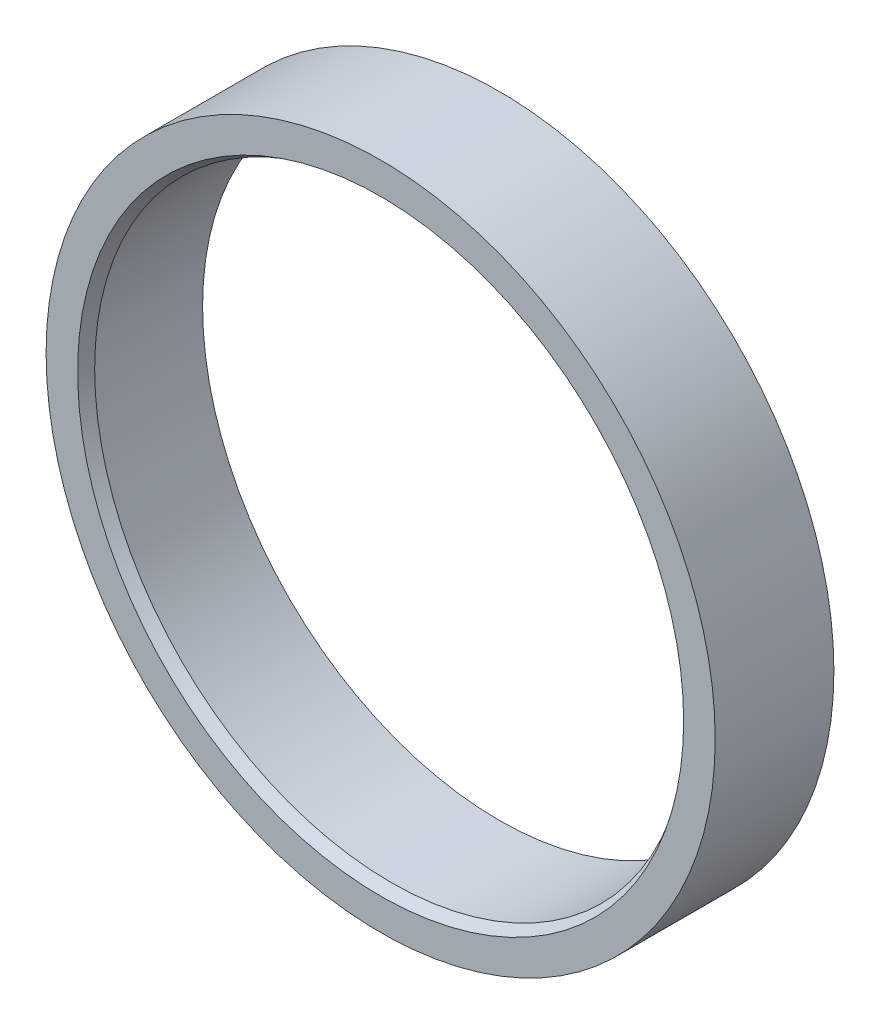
ISO-10303-21;
HEADER;
FILE_DESCRIPTION(('STEP AP214'),'2;1');
FILE_NAME('part.step','',(''),(''),'','','');
FILE_SCHEMA(('AUTOMOTIVE_DESIGN { 1 0 10303 214 1 1 1 1 }'));
ENDSEC;
DATA;
#1=APPLICATION_CONTEXT('core data for automotive mechanical design processes');
#2=APPLICATION_PROTOCOL_DEFINITION('international standard','automotive_design',2000,#1);
#3=PRODUCT_CONTEXT('',#1,'mechanical');
#4=PRODUCT('Part','Part','',(#3));
#5=PRODUCT_RELATED_PRODUCT_CATEGORY('part','',(#4));
#6=PRODUCT_DEFINITION_FORMATION('','',#4);
#7=PRODUCT_DEFINITION_CONTEXT('part definition',#1,'design');
#8=PRODUCT_DEFINITION('design','',#6,#7);
#9=PRODUCT_DEFINITION_SHAPE('','',#8);
#10=(LENGTH_UNIT() NAMED_UNIT(*) SI_UNIT(.MILLI.,.METRE.));
#11=(NAMED_UNIT(*) PLANE_ANGLE_UNIT() SI_UNIT($,.RADIAN.));
#12=(NAMED_UNIT(*) SI_UNIT($,.STERADIAN.) SOLID_ANGLE_UNIT());
#13=UNCERTAINTY_MEASURE_WITH_UNIT(LENGTH_MEASURE(1.E-05),#10,'distance_accuracy_value','');
#14=(GEOMETRIC_REPRESENTATION_CONTEXT(3) GLOBAL_UNCERTAINTY_ASSIGNED_CONTEXT((#13)) GLOBAL_UNIT_ASSIGNED_CONTEXT((#10,
#11,#12)) REPRESENTATION_CONTEXT('',''));
#15=CARTESIAN_POINT('',(0.,0.,0.));
#16=DIRECTION('',(0.,0.,1.));
#17=DIRECTION('',(1.,0.,0.));
#18=AXIS2_PLACEMENT_3D('',#15,#16,#17);
#19=CARTESIAN_POINT('',(0.,27.5,-11.));
#20=DIRECTION('',(0.,0.,1.));
#21=DIRECTION('',(1.,0.,0.));
#22=AXIS2_PLACEMENT_3D('',#19,#20,#21);
#23=PLANE('',#22);
#24=CARTESIAN_POINT('',(0.,0.,-11.));
#25=DIRECTION('',(0.,0.,1.));
#26=DIRECTION('',(1.,0.,0.));
#27=AXIS2_PLACEMENT_3D('',#24,#25,#26);
#28=CIRCLE('',#27,31.);
#29=CARTESIAN_POINT('',(31.,0.,-11.));
#30=VERTEX_POINT('',#29);
#31=EDGE_CURVE('E10',#30,#30,#28,.T.);
#32=ORIENTED_EDGE('',*,*,#31,.F.);
#33=EDGE_LOOP('',(#32));
#34=FACE_BOUND('',#33,.T.);
#35=CARTESIAN_POINT('',(0.,0.,-11.));
#36=DIRECTION('',(0.,0.,1.));
#37=DIRECTION('',(1.,0.,0.));
#38=AXIS2_PLACEMENT_3D('',#35,#36,#37);
#39=CIRCLE('',#38,27.5);
#40=CARTESIAN_POINT('',(27.5,0.,-11.));
#41=VERTEX_POINT('',#40);
#42=EDGE_CURVE('E48',#41,#41,#39,.T.);
#43=ORIENTED_EDGE('',*,*,#42,.T.);
#44=EDGE_LOOP('',(#43));
#45=FACE_BOUND('',#44,.T.);
#46=ADVANCED_FACE('F29',(#34,#45),#23,.F.);
#47=CARTESIAN_POINT('',(0.,0.,0.));
#48=DIRECTION('',(0.,0.,1.));
#49=DIRECTION('',(1.,0.,0.));
#50=AXIS2_PLACEMENT_3D('',#47,#48,#49);
#51=CYLINDRICAL_SURFACE('',#50,31.);
#52=CARTESIAN_POINT('',(0.,0.,0.));
#53=DIRECTION('',(0.,0.,1.));
#54=DIRECTION('',(1.,0.,0.));
#55=AXIS2_PLACEMENT_3D('',#52,#53,#54);
#56=CIRCLE('',#55,31.);
#57=CARTESIAN_POINT('',(31.,0.,0.));
#58=VERTEX_POINT('',#57);
#59=EDGE_CURVE('E35',#58,#58,#56,.T.);
#60=ORIENTED_EDGE('',*,*,#59,.F.);
#61=EDGE_LOOP('',(#60));
#62=FACE_BOUND('',#61,.T.);
#63=ORIENTED_EDGE('',*,*,#31,.T.);
#64=EDGE_LOOP('',(#63));
#65=FACE_BOUND('',#64,.T.);
#66=ADVANCED_FACE('F67',(#62,#65),#51,.T.);
#67=CARTESIAN_POINT('',(0.,31.,0.));
#68=DIRECTION('',(0.,0.,-1.));
#69=DIRECTION('',(-1.,0.,0.));
#70=AXIS2_PLACEMENT_3D('',#67,#68,#69);
#71=PLANE('',#70);
#72=CARTESIAN_POINT('',(0.,0.,0.));
#73=DIRECTION('',(0.,0.,1.));
#74=DIRECTION('',(1.,0.,0.));
#75=AXIS2_PLACEMENT_3D('',#72,#73,#74);
#76=CIRCLE('',#75,28.0773502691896);
#77=CARTESIAN_POINT('',(28.0773502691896,0.,0.));
#78=VERTEX_POINT('',#77);
#79=EDGE_CURVE('E39',#78,#78,#76,.T.);
#80=ORIENTED_EDGE('',*,*,#79,.F.);
#81=EDGE_LOOP('',(#80));
#82=FACE_BOUND('',#81,.T.);
#83=ORIENTED_EDGE('',*,*,#59,.T.);
#84=EDGE_LOOP('',(#83));
#85=FACE_BOUND('',#84,.T.);
#86=ADVANCED_FACE('F62',(#82,#85),#71,.F.);
#87=CARTESIAN_POINT('',(0.,0.,0.));
#88=DIRECTION('',(0.,0.,1.));
#89=DIRECTION('',(1.,0.,0.));
#90=AXIS2_PLACEMENT_3D('',#87,#88,#89);
#91=CONICAL_SURFACE('',#90,28.0773502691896,0.523598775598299);
#92=CARTESIAN_POINT('',(0.,0.,-1.));
#93=DIRECTION('',(0.,0.,1.));
#94=DIRECTION('',(1.,0.,0.));
#95=AXIS2_PLACEMENT_3D('',#92,#93,#94);
#96=CIRCLE('',#95,27.5);
#97=CARTESIAN_POINT('',(27.5,0.,-1.));
#98=VERTEX_POINT('',#97);
#99=EDGE_CURVE('E43',#98,#98,#96,.T.);
#100=ORIENTED_EDGE('',*,*,#99,.F.);
#101=EDGE_LOOP('',(#100));
#102=FACE_BOUND('',#101,.T.);
#103=ORIENTED_EDGE('',*,*,#79,.T.);
#104=EDGE_LOOP('',(#103));
#105=FACE_BOUND('',#104,.T.);
#106=ADVANCED_FACE('F56',(#102,#105),#91,.F.);
#107=CARTESIAN_POINT('',(0.,0.,0.));
#108=DIRECTION('',(0.,0.,1.));
#109=DIRECTION('',(1.,0.,0.));
#110=AXIS2_PLACEMENT_3D('',#107,#108,#109);
#111=CYLINDRICAL_SURFACE('',#110,27.5);
#112=ORIENTED_EDGE('',*,*,#42,.F.);
#113=EDGE_LOOP('',(#112));
#114=FACE_BOUND('',#113,.T.);
#115=ORIENTED_EDGE('',*,*,#99,.T.);
#116=EDGE_LOOP('',(#115));
#117=FACE_BOUND('',#116,.T.);
#118=ADVANCED_FACE('F53',(#114,#117),#111,.F.);
#119=CLOSED_SHELL('',(#46,#66,#86,#106,#118));
#120=MANIFOLD_SOLID_BREP('B2',#119);
#121=ADVANCED_BREP_SHAPE_REPRESENTATION('',(#18,#120),#14);
#122=SHAPE_DEFINITION_REPRESENTATION(#9,#121);
ENDSEC;
END-ISO-10303-21;
